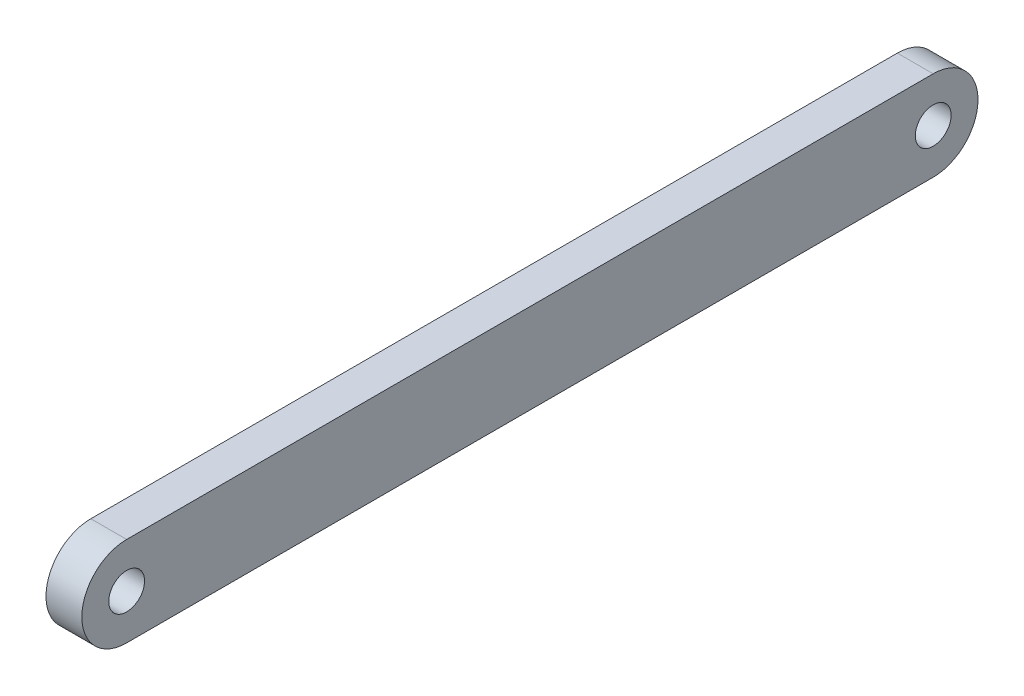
ISO-10303-21;
HEADER;
FILE_DESCRIPTION(('STEP AP214'),'2;1');
FILE_NAME('part.step','',(''),(''),'','','');
FILE_SCHEMA(('AUTOMOTIVE_DESIGN { 1 0 10303 214 1 1 1 1 }'));
ENDSEC;
DATA;
#1=APPLICATION_CONTEXT('core data for automotive mechanical design processes');
#2=APPLICATION_PROTOCOL_DEFINITION('international standard','automotive_design',2000,#1);
#3=PRODUCT_CONTEXT('',#1,'mechanical');
#4=PRODUCT('Part','Part','',(#3));
#5=PRODUCT_RELATED_PRODUCT_CATEGORY('part','',(#4));
#6=PRODUCT_DEFINITION_FORMATION('','',#4);
#7=PRODUCT_DEFINITION_CONTEXT('part definition',#1,'design');
#8=PRODUCT_DEFINITION('design','',#6,#7);
#9=PRODUCT_DEFINITION_SHAPE('','',#8);
#10=(LENGTH_UNIT() NAMED_UNIT(*) SI_UNIT(.MILLI.,.METRE.));
#11=(NAMED_UNIT(*) PLANE_ANGLE_UNIT() SI_UNIT($,.RADIAN.));
#12=(NAMED_UNIT(*) SI_UNIT($,.STERADIAN.) SOLID_ANGLE_UNIT());
#13=UNCERTAINTY_MEASURE_WITH_UNIT(LENGTH_MEASURE(1.E-05),#10,'distance_accuracy_value','');
#14=(GEOMETRIC_REPRESENTATION_CONTEXT(3) GLOBAL_UNCERTAINTY_ASSIGNED_CONTEXT((#13)) GLOBAL_UNIT_ASSIGNED_CONTEXT((#10,
#11,#12)) REPRESENTATION_CONTEXT('',''));
#15=CARTESIAN_POINT('',(0.,0.,0.));
#16=DIRECTION('',(0.,0.,1.));
#17=DIRECTION('',(1.,0.,0.));
#18=AXIS2_PLACEMENT_3D('',#15,#16,#17);
#19=CARTESIAN_POINT('',(-36.,0.,0.));
#20=DIRECTION('',(1.,0.,0.));
#21=DIRECTION('',(0.,0.,-1.));
#22=AXIS2_PLACEMENT_3D('',#19,#20,#21);
#23=CYLINDRICAL_SURFACE('',#22,45.);
#24=CARTESIAN_POINT('',(0.,0.,0.));
#25=DIRECTION('',(1.,0.,0.));
#26=DIRECTION('',(0.,0.,-1.));
#27=AXIS2_PLACEMENT_3D('',#24,#25,#26);
#28=CIRCLE('',#27,45.);
#29=CARTESIAN_POINT('',(0.,45.,0.));
#30=VERTEX_POINT('',#29);
#31=CARTESIAN_POINT('',(0.,-45.,0.));
#32=VERTEX_POINT('',#31);
#33=EDGE_CURVE('E100',#30,#32,#28,.T.);
#34=ORIENTED_EDGE('',*,*,#33,.F.);
#35=DIRECTION('',(1.,0.,0.));
#36=VECTOR('',#35,1.);
#37=CARTESIAN_POINT('',(-36.,45.,0.));
#38=LINE('',#37,#36);
#39=CARTESIAN_POINT('',(-36.,45.,0.));
#40=VERTEX_POINT('',#39);
#41=EDGE_CURVE('E11',#40,#30,#38,.T.);
#42=ORIENTED_EDGE('',*,*,#41,.F.);
#43=CARTESIAN_POINT('',(-36.,0.,0.));
#44=DIRECTION('',(1.,0.,0.));
#45=DIRECTION('',(0.,0.,-1.));
#46=AXIS2_PLACEMENT_3D('',#43,#44,#45);
#47=CIRCLE('',#46,45.);
#48=CARTESIAN_POINT('',(-36.,-45.,0.));
#49=VERTEX_POINT('',#48);
#50=EDGE_CURVE('E93',#40,#49,#47,.T.);
#51=ORIENTED_EDGE('',*,*,#50,.T.);
#52=DIRECTION('',(1.,0.,0.));
#53=VECTOR('',#52,1.);
#54=CARTESIAN_POINT('',(-36.,-45.,0.));
#55=LINE('',#54,#53);
#56=EDGE_CURVE('E38',#49,#32,#55,.T.);
#57=ORIENTED_EDGE('',*,*,#56,.T.);
#58=EDGE_LOOP('',(#34,#42,#51,#57));
#59=FACE_BOUND('',#58,.T.);
#60=ADVANCED_FACE('F35',(#59),#23,.T.);
#61=CARTESIAN_POINT('',(-36.,45.,0.));
#62=DIRECTION('',(0.,1.,0.));
#63=DIRECTION('',(0.,0.,1.));
#64=AXIS2_PLACEMENT_3D('',#61,#62,#63);
#65=PLANE('',#64);
#66=DIRECTION('',(0.,0.,1.));
#67=VECTOR('',#66,1.);
#68=CARTESIAN_POINT('',(0.,45.,0.));
#69=LINE('',#68,#67);
#70=CARTESIAN_POINT('',(0.,45.,-810.));
#71=VERTEX_POINT('',#70);
#72=EDGE_CURVE('E95',#71,#30,#69,.T.);
#73=ORIENTED_EDGE('',*,*,#72,.F.);
#74=DIRECTION('',(1.,0.,0.));
#75=VECTOR('',#74,1.);
#76=CARTESIAN_POINT('',(-36.,45.,-810.));
#77=LINE('',#76,#75);
#78=CARTESIAN_POINT('',(-36.,45.,-810.));
#79=VERTEX_POINT('',#78);
#80=EDGE_CURVE('E44',#79,#71,#77,.T.);
#81=ORIENTED_EDGE('',*,*,#80,.F.);
#82=DIRECTION('',(0.,0.,1.));
#83=VECTOR('',#82,1.);
#84=CARTESIAN_POINT('',(-36.,45.,0.));
#85=LINE('',#84,#83);
#86=EDGE_CURVE('E90',#79,#40,#85,.T.);
#87=ORIENTED_EDGE('',*,*,#86,.T.);
#88=ORIENTED_EDGE('',*,*,#41,.T.);
#89=EDGE_LOOP('',(#73,#81,#87,#88));
#90=FACE_BOUND('',#89,.T.);
#91=ADVANCED_FACE('F111',(#90),#65,.T.);
#92=CARTESIAN_POINT('',(-36.,0.,-810.));
#93=DIRECTION('',(1.,0.,0.));
#94=DIRECTION('',(0.,0.,-1.));
#95=AXIS2_PLACEMENT_3D('',#92,#93,#94);
#96=CYLINDRICAL_SURFACE('',#95,45.);
#97=CARTESIAN_POINT('',(0.,0.,-810.));
#98=DIRECTION('',(1.,0.,0.));
#99=DIRECTION('',(0.,0.,1.));
#100=AXIS2_PLACEMENT_3D('',#97,#98,#99);
#101=CIRCLE('',#100,45.);
#102=CARTESIAN_POINT('',(0.,-45.0000000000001,-810.));
#103=VERTEX_POINT('',#102);
#104=EDGE_CURVE('E85',#103,#71,#101,.T.);
#105=ORIENTED_EDGE('',*,*,#104,.F.);
#106=DIRECTION('',(1.,0.,0.));
#107=VECTOR('',#106,1.);
#108=CARTESIAN_POINT('',(-36.,-45.0000000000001,-810.));
#109=LINE('',#108,#107);
#110=CARTESIAN_POINT('',(-36.,-45.0000000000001,-810.));
#111=VERTEX_POINT('',#110);
#112=EDGE_CURVE('E80',#111,#103,#109,.T.);
#113=ORIENTED_EDGE('',*,*,#112,.F.);
#114=CARTESIAN_POINT('',(-36.,0.,-810.));
#115=DIRECTION('',(1.,0.,0.));
#116=DIRECTION('',(0.,0.,1.));
#117=AXIS2_PLACEMENT_3D('',#114,#115,#116);
#118=CIRCLE('',#117,45.);
#119=EDGE_CURVE('E83',#111,#79,#118,.T.);
#120=ORIENTED_EDGE('',*,*,#119,.T.);
#121=ORIENTED_EDGE('',*,*,#80,.T.);
#122=EDGE_LOOP('',(#105,#113,#120,#121));
#123=FACE_BOUND('',#122,.T.);
#124=ADVANCED_FACE('F82',(#123),#96,.T.);
#125=CARTESIAN_POINT('',(-36.,-45.,0.));
#126=DIRECTION('',(0.,-1.,0.));
#127=DIRECTION('',(0.,0.,-1.));
#128=AXIS2_PLACEMENT_3D('',#125,#126,#127);
#129=PLANE('',#128);
#130=DIRECTION('',(0.,0.,-1.));
#131=VECTOR('',#130,1.);
#132=CARTESIAN_POINT('',(0.,-45.,0.));
#133=LINE('',#132,#131);
#134=EDGE_CURVE('E103',#32,#103,#133,.T.);
#135=ORIENTED_EDGE('',*,*,#134,.F.);
#136=ORIENTED_EDGE('',*,*,#56,.F.);
#137=DIRECTION('',(0.,0.,-1.));
#138=VECTOR('',#137,1.);
#139=CARTESIAN_POINT('',(-36.,-45.,0.));
#140=LINE('',#139,#138);
#141=EDGE_CURVE('E89',#49,#111,#140,.T.);
#142=ORIENTED_EDGE('',*,*,#141,.T.);
#143=ORIENTED_EDGE('',*,*,#112,.T.);
#144=EDGE_LOOP('',(#135,#136,#142,#143));
#145=FACE_BOUND('',#144,.T.);
#146=ADVANCED_FACE('F92',(#145),#129,.T.);
#147=CARTESIAN_POINT('',(-36.,0.,0.));
#148=DIRECTION('',(1.,0.,0.));
#149=DIRECTION('',(0.,0.,-1.));
#150=AXIS2_PLACEMENT_3D('',#147,#148,#149);
#151=PLANE('',#150);
#152=CARTESIAN_POINT('',(-36.,0.,-810.));
#153=DIRECTION('',(1.,0.,0.));
#154=DIRECTION('',(0.,0.,-1.));
#155=AXIS2_PLACEMENT_3D('',#152,#153,#154);
#156=CIRCLE('',#155,18.);
#157=CARTESIAN_POINT('',(-36.,0.,-828.));
#158=VERTEX_POINT('',#157);
#159=EDGE_CURVE('E144',#158,#158,#156,.T.);
#160=ORIENTED_EDGE('',*,*,#159,.T.);
#161=EDGE_LOOP('',(#160));
#162=FACE_BOUND('',#161,.T.);
#163=CARTESIAN_POINT('',(-36.,0.,0.));
#164=DIRECTION('',(1.,0.,0.));
#165=DIRECTION('',(0.,0.,-1.));
#166=AXIS2_PLACEMENT_3D('',#163,#164,#165);
#167=CIRCLE('',#166,18.);
#168=CARTESIAN_POINT('',(-36.,0.,-18.));
#169=VERTEX_POINT('',#168);
#170=EDGE_CURVE('E104',#169,#169,#167,.T.);
#171=ORIENTED_EDGE('',*,*,#170,.T.);
#172=EDGE_LOOP('',(#171));
#173=FACE_BOUND('',#172,.T.);
#174=ORIENTED_EDGE('',*,*,#50,.F.);
#175=ORIENTED_EDGE('',*,*,#86,.F.);
#176=ORIENTED_EDGE('',*,*,#119,.F.);
#177=ORIENTED_EDGE('',*,*,#141,.F.);
#178=EDGE_LOOP('',(#174,#175,#176,#177));
#179=FACE_BOUND('',#178,.T.);
#180=ADVANCED_FACE('F88',(#162,#173,#179),#151,.F.);
#181=CARTESIAN_POINT('',(0.,0.,0.));
#182=DIRECTION('',(1.,0.,0.));
#183=DIRECTION('',(0.,0.,-1.));
#184=AXIS2_PLACEMENT_3D('',#181,#182,#183);
#185=PLANE('',#184);
#186=CARTESIAN_POINT('',(0.,0.,-810.));
#187=DIRECTION('',(1.,0.,0.));
#188=DIRECTION('',(0.,0.,-1.));
#189=AXIS2_PLACEMENT_3D('',#186,#187,#188);
#190=CIRCLE('',#189,18.);
#191=CARTESIAN_POINT('',(0.,0.,-828.));
#192=VERTEX_POINT('',#191);
#193=EDGE_CURVE('E147',#192,#192,#190,.T.);
#194=ORIENTED_EDGE('',*,*,#193,.F.);
#195=EDGE_LOOP('',(#194));
#196=FACE_BOUND('',#195,.T.);
#197=CARTESIAN_POINT('',(0.,0.,0.));
#198=DIRECTION('',(1.,0.,0.));
#199=DIRECTION('',(0.,0.,-1.));
#200=AXIS2_PLACEMENT_3D('',#197,#198,#199);
#201=CIRCLE('',#200,18.);
#202=CARTESIAN_POINT('',(0.,0.,-18.));
#203=VERTEX_POINT('',#202);
#204=EDGE_CURVE('E149',#203,#203,#201,.T.);
#205=ORIENTED_EDGE('',*,*,#204,.F.);
#206=EDGE_LOOP('',(#205));
#207=FACE_BOUND('',#206,.T.);
#208=ORIENTED_EDGE('',*,*,#33,.T.);
#209=ORIENTED_EDGE('',*,*,#134,.T.);
#210=ORIENTED_EDGE('',*,*,#104,.T.);
#211=ORIENTED_EDGE('',*,*,#72,.T.);
#212=EDGE_LOOP('',(#208,#209,#210,#211));
#213=FACE_BOUND('',#212,.T.);
#214=ADVANCED_FACE('F110',(#196,#207,#213),#185,.T.);
#215=CARTESIAN_POINT('',(-36.,0.,0.));
#216=DIRECTION('',(1.,0.,0.));
#217=DIRECTION('',(0.,0.,-1.));
#218=AXIS2_PLACEMENT_3D('',#215,#216,#217);
#219=CYLINDRICAL_SURFACE('',#218,18.);
#220=ORIENTED_EDGE('',*,*,#170,.F.);
#221=EDGE_LOOP('',(#220));
#222=FACE_BOUND('',#221,.T.);
#223=ORIENTED_EDGE('',*,*,#204,.T.);
#224=EDGE_LOOP('',(#223));
#225=FACE_BOUND('',#224,.T.);
#226=ADVANCED_FACE('F129',(#222,#225),#219,.F.);
#227=CARTESIAN_POINT('',(-36.,0.,-810.));
#228=DIRECTION('',(1.,0.,0.));
#229=DIRECTION('',(0.,0.,-1.));
#230=AXIS2_PLACEMENT_3D('',#227,#228,#229);
#231=CYLINDRICAL_SURFACE('',#230,18.);
#232=ORIENTED_EDGE('',*,*,#159,.F.);
#233=EDGE_LOOP('',(#232));
#234=FACE_BOUND('',#233,.T.);
#235=ORIENTED_EDGE('',*,*,#193,.T.);
#236=EDGE_LOOP('',(#235));
#237=FACE_BOUND('',#236,.T.);
#238=ADVANCED_FACE('F136',(#234,#237),#231,.F.);
#239=CLOSED_SHELL('',(#60,#91,#124,#146,#180,#214,#226,#238));
#240=MANIFOLD_SOLID_BREP('B2',#239);
#241=ADVANCED_BREP_SHAPE_REPRESENTATION('',(#18,#240),#14);
#242=SHAPE_DEFINITION_REPRESENTATION(#9,#241);
ENDSEC;
END-ISO-10303-21;
